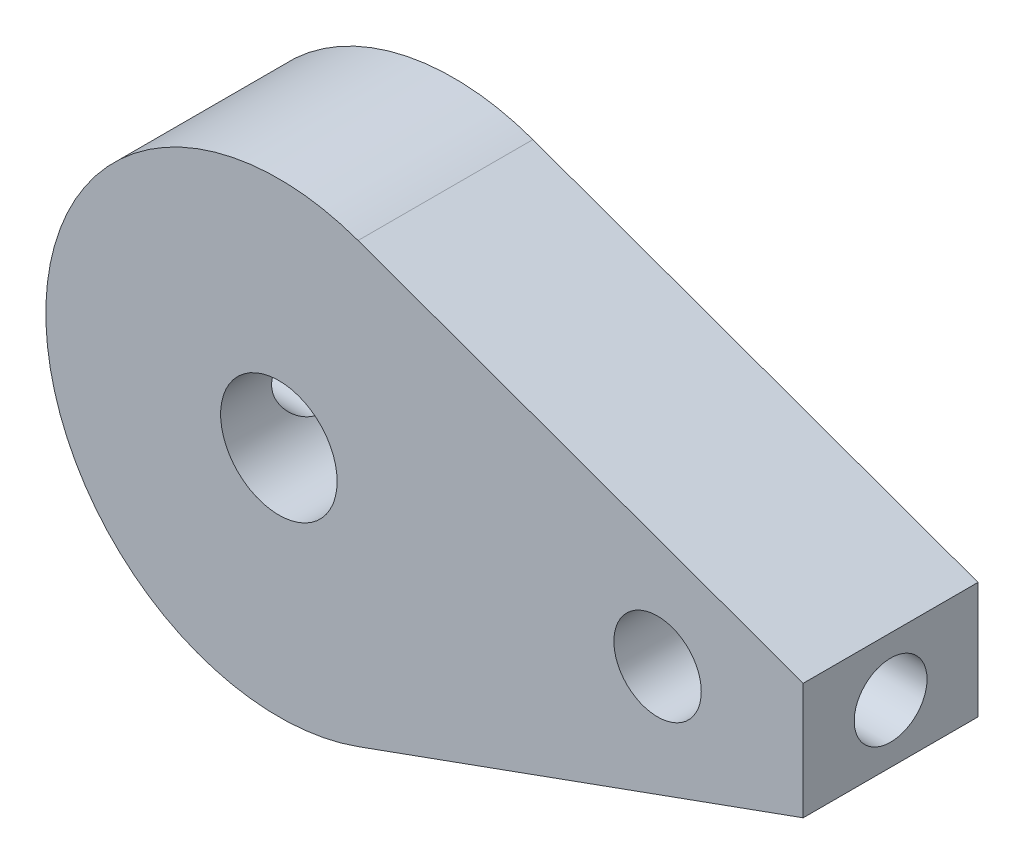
from build123d import *

# Parameters (mm, degrees)
ESQUISSE1_R            = 1.5
ESQUISSE1_R_2          = 2
BOSS_EXTRU_1_DEPTH     = 6
TROU_TARAUD_M31_REACH  = 29.857
TROU_TARAUD_M31_BORE_R = 1.25
TROU_TARAUD_M32_REACH  = 29.857
TROU_TARAUD_M32_BORE_R = 1.25


with BuildPart() as part:
    # Esquisse1 → Boss.-Extru.1 (new body)
    with BuildSketch(Plane.XY):
        with BuildLine():
            Line((0, -2), (0, 2))
            Line((0, 2), (-15.280393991, 7.523545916))
            ThreePointArc((-15.280393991, 7.523545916), (-26, 0), (-15.280393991, -7.523545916))
            Line((-15.280393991, -7.523545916), (0, -2))
        make_face()
        with Locations((-5, 0)):
            Circle(ESQUISSE1_R, mode=Mode.SUBTRACT)
        with Locations((-18, 0)):
            Circle(ESQUISSE1_R_2, mode=Mode.SUBTRACT)
    extrude(amount=BOSS_EXTRU_1_DEPTH)

    # Trou taraud_ M31 bore → Trou taraud_ M31 (cut, up to next)
    with BuildSketch(Plane(origin=(0, 0, 0), x_dir=(0, 0, -1), z_dir=(1, 0, 0)), mode=Mode.PRIVATE) as trou_taraud_m31_sk1:
        with Locations((-3, 0)):
            Circle(TROU_TARAUD_M31_BORE_R)
    trou_taraud_m31_tool1 = extrude(trou_taraud_m31_sk1.sketch, amount=-TROU_TARAUD_M31_REACH, mode=Mode.PRIVATE) & part.part
    add(trou_taraud_m31_tool1.solids().sort_by_distance((0, 0, 3))[0], mode=Mode.SUBTRACT)

    # Trou taraud_ M32 bore → Trou taraud_ M32 (cut, up to next)
    with BuildSketch(Plane(origin=(-26, 0, 0), x_dir=(0, 0, -1), z_dir=(-1, 0, 0)), mode=Mode.PRIVATE) as trou_taraud_m32_sk1:
        with Locations((-3, 0)):
            Circle(TROU_TARAUD_M32_BORE_R)
    trou_taraud_m32_tool1 = extrude(trou_taraud_m32_sk1.sketch, amount=-TROU_TARAUD_M32_REACH, mode=Mode.PRIVATE) & part.part
    add(trou_taraud_m32_tool1.solids().sort_by_distance((-26, 0, 3))[0], mode=Mode.SUBTRACT)


solid = part.part
